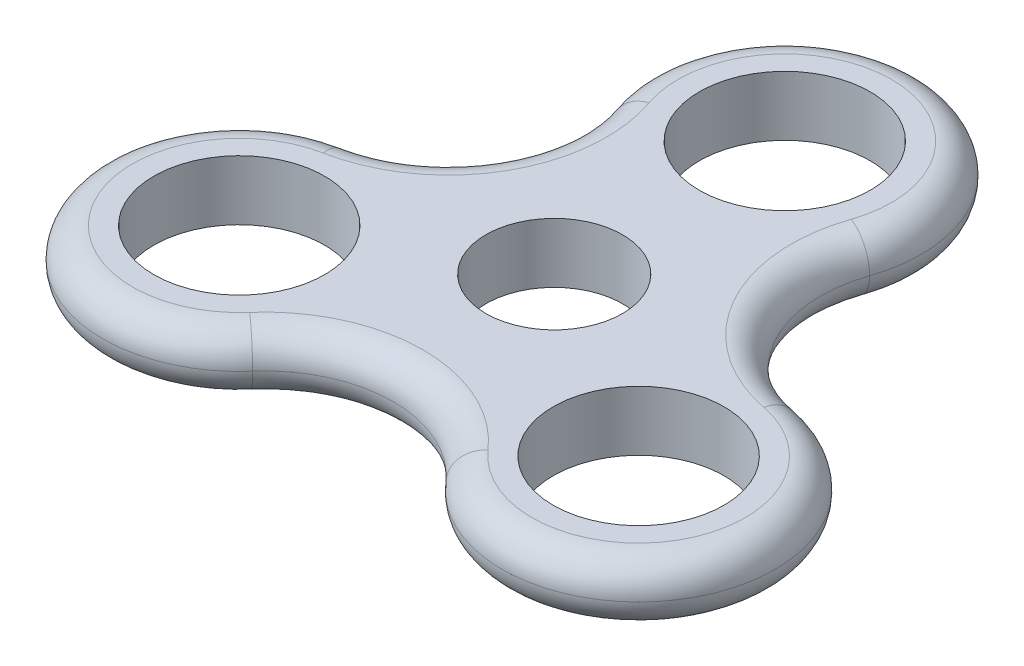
ISO-10303-21;
HEADER;
FILE_DESCRIPTION(('STEP AP214'),'2;1');
FILE_NAME('part.step','',(''),(''),'','','');
FILE_SCHEMA(('AUTOMOTIVE_DESIGN { 1 0 10303 214 1 1 1 1 }'));
ENDSEC;
DATA;
#1=APPLICATION_CONTEXT('core data for automotive mechanical design processes');
#2=APPLICATION_PROTOCOL_DEFINITION('international standard','automotive_design',2000,#1);
#3=PRODUCT_CONTEXT('',#1,'mechanical');
#4=PRODUCT('Part','Part','',(#3));
#5=PRODUCT_RELATED_PRODUCT_CATEGORY('part','',(#4));
#6=PRODUCT_DEFINITION_FORMATION('','',#4);
#7=PRODUCT_DEFINITION_CONTEXT('part definition',#1,'design');
#8=PRODUCT_DEFINITION('design','',#6,#7);
#9=PRODUCT_DEFINITION_SHAPE('','',#8);
#10=(LENGTH_UNIT() NAMED_UNIT(*) SI_UNIT(.MILLI.,.METRE.));
#11=(NAMED_UNIT(*) PLANE_ANGLE_UNIT() SI_UNIT($,.RADIAN.));
#12=(NAMED_UNIT(*) SI_UNIT($,.STERADIAN.) SOLID_ANGLE_UNIT());
#13=UNCERTAINTY_MEASURE_WITH_UNIT(LENGTH_MEASURE(1.E-05),#10,'distance_accuracy_value','');
#14=(GEOMETRIC_REPRESENTATION_CONTEXT(3) GLOBAL_UNCERTAINTY_ASSIGNED_CONTEXT((#13)) GLOBAL_UNIT_ASSIGNED_CONTEXT((#10,
#11,#12)) REPRESENTATION_CONTEXT('',''));
#15=CARTESIAN_POINT('',(0.,0.,0.));
#16=DIRECTION('',(0.,0.,1.));
#17=DIRECTION('',(1.,0.,0.));
#18=AXIS2_PLACEMENT_3D('',#15,#16,#17);
#19=CARTESIAN_POINT('',(-26.3501792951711,7.,-1.71328310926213));
#20=DIRECTION('',(0.,-1.,0.));
#21=DIRECTION('',(0.,0.,-1.));
#22=AXIS2_PLACEMENT_3D('',#19,#20,#21);
#23=PLANE('',#22);
#24=CARTESIAN_POINT('',(23.38268590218,7.,13.4999999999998));
#25=DIRECTION('',(0.,-1.,0.));
#26=DIRECTION('',(0.,0.,-1.));
#27=AXIS2_PLACEMENT_3D('',#24,#25,#26);
#28=CIRCLE('',#27,12.5);
#29=CARTESIAN_POINT('',(13.9541835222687,7.,21.7069082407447));
#30=VERTEX_POINT('',#29);
#31=CARTESIAN_POINT('',(25.7758257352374,7.,1.23122329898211));
#32=VERTEX_POINT('',#31);
#33=EDGE_CURVE('E46',#30,#32,#28,.F.);
#34=ORIENTED_EDGE('',*,*,#33,.T.);
#35=CARTESIAN_POINT('',(29.3176726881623,7.,-16.926566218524));
#36=DIRECTION('',(0.,-1.,0.));
#37=DIRECTION('',(0.,0.,-1.));
#38=AXIS2_PLACEMENT_3D('',#35,#36,#37);
#39=CIRCLE('',#38,18.5);
#40=CARTESIAN_POINT('',(11.8216422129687,7.,-22.9381315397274));
#41=VERTEX_POINT('',#40);
#42=EDGE_CURVE('E11',#32,#41,#39,.T.);
#43=ORIENTED_EDGE('',*,*,#42,.T.);
#44=CARTESIAN_POINT('',(0.,7.,-27.));
#45=DIRECTION('',(0.,-1.,0.));
#46=DIRECTION('',(0.,0.,-1.));
#47=AXIS2_PLACEMENT_3D('',#44,#45,#46);
#48=CIRCLE('',#47,12.5);
#49=CARTESIAN_POINT('',(-11.8216422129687,7.,-22.9381315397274));
#50=VERTEX_POINT('',#49);
#51=EDGE_CURVE('E195',#41,#50,#48,.F.);
#52=ORIENTED_EDGE('',*,*,#51,.T.);
#53=CARTESIAN_POINT('',(-29.3176726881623,7.,-16.926566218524));
#54=DIRECTION('',(0.,-1.,0.));
#55=DIRECTION('',(0.,0.,-1.));
#56=AXIS2_PLACEMENT_3D('',#53,#54,#55);
#57=CIRCLE('',#56,18.5);
#58=CARTESIAN_POINT('',(-25.7758257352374,7.,1.23122329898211));
#59=VERTEX_POINT('',#58);
#60=EDGE_CURVE('E119',#50,#59,#57,.T.);
#61=ORIENTED_EDGE('',*,*,#60,.T.);
#62=CARTESIAN_POINT('',(-23.38268590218,7.,13.4999999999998));
#63=DIRECTION('',(0.,-1.,0.));
#64=DIRECTION('',(0.,0.,-1.));
#65=AXIS2_PLACEMENT_3D('',#62,#63,#64);
#66=CIRCLE('',#65,12.5);
#67=CARTESIAN_POINT('',(-13.9541835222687,7.,21.7069082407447));
#68=VERTEX_POINT('',#67);
#69=EDGE_CURVE('E114',#59,#68,#66,.F.);
#70=ORIENTED_EDGE('',*,*,#69,.T.);
#71=CARTESIAN_POINT('',(0.,7.,33.8531324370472));
#72=DIRECTION('',(0.,-1.,0.));
#73=DIRECTION('',(0.,0.,-1.));
#74=AXIS2_PLACEMENT_3D('',#71,#72,#73);
#75=CIRCLE('',#74,18.5);
#76=EDGE_CURVE('E116',#68,#30,#75,.T.);
#77=ORIENTED_EDGE('',*,*,#76,.T.);
#78=EDGE_LOOP('',(#34,#43,#52,#61,#70,#77));
#79=FACE_BOUND('',#78,.T.);
#80=CARTESIAN_POINT('',(0.,7.,0.));
#81=DIRECTION('',(0.,1.,0.));
#82=DIRECTION('',(0.,0.,1.));
#83=AXIS2_PLACEMENT_3D('',#80,#81,#82);
#84=CIRCLE('',#83,8.);
#85=CARTESIAN_POINT('',(0.,7.,8.));
#86=VERTEX_POINT('',#85);
#87=EDGE_CURVE('E210',#86,#86,#84,.T.);
#88=ORIENTED_EDGE('',*,*,#87,.F.);
#89=EDGE_LOOP('',(#88));
#90=FACE_BOUND('',#89,.T.);
#91=CARTESIAN_POINT('',(-23.38268590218,7.,13.4999999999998));
#92=DIRECTION('',(0.,1.,0.));
#93=DIRECTION('',(0.,0.,1.));
#94=AXIS2_PLACEMENT_3D('',#91,#92,#93);
#95=CIRCLE('',#94,9.99999999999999);
#96=CARTESIAN_POINT('',(-23.38268590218,7.,23.4999999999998));
#97=VERTEX_POINT('',#96);
#98=EDGE_CURVE('E214',#97,#97,#95,.T.);
#99=ORIENTED_EDGE('',*,*,#98,.F.);
#100=EDGE_LOOP('',(#99));
#101=FACE_BOUND('',#100,.T.);
#102=CARTESIAN_POINT('',(23.38268590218,7.,13.4999999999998));
#103=DIRECTION('',(0.,1.,0.));
#104=DIRECTION('',(0.,0.,1.));
#105=AXIS2_PLACEMENT_3D('',#102,#103,#104);
#106=CIRCLE('',#105,10.);
#107=CARTESIAN_POINT('',(23.38268590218,7.,23.4999999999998));
#108=VERTEX_POINT('',#107);
#109=EDGE_CURVE('E220',#108,#108,#106,.T.);
#110=ORIENTED_EDGE('',*,*,#109,.F.);
#111=EDGE_LOOP('',(#110));
#112=FACE_BOUND('',#111,.T.);
#113=CARTESIAN_POINT('',(0.,7.,-27.));
#114=DIRECTION('',(0.,1.,0.));
#115=DIRECTION('',(0.,0.,1.));
#116=AXIS2_PLACEMENT_3D('',#113,#114,#115);
#117=CIRCLE('',#116,10.);
#118=CARTESIAN_POINT('',(0.,7.,-17.));
#119=VERTEX_POINT('',#118);
#120=EDGE_CURVE('E226',#119,#119,#117,.T.);
#121=ORIENTED_EDGE('',*,*,#120,.F.);
#122=EDGE_LOOP('',(#121));
#123=FACE_BOUND('',#122,.T.);
#124=ADVANCED_FACE('F36',(#79,#90,#101,#112,#123),#23,.F.);
#125=CARTESIAN_POINT('',(-26.3501792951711,0.,-1.71328310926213));
#126=DIRECTION('',(0.,-1.,0.));
#127=DIRECTION('',(0.,0.,-1.));
#128=AXIS2_PLACEMENT_3D('',#125,#126,#127);
#129=PLANE('',#128);
#130=CARTESIAN_POINT('',(0.,0.,-27.));
#131=DIRECTION('',(0.,-1.,0.));
#132=DIRECTION('',(0.,0.,-1.));
#133=AXIS2_PLACEMENT_3D('',#130,#131,#132);
#134=CIRCLE('',#133,12.5);
#135=CARTESIAN_POINT('',(-11.8216422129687,0.,-22.9381315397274));
#136=VERTEX_POINT('',#135);
#137=CARTESIAN_POINT('',(11.8216422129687,0.,-22.9381315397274));
#138=VERTEX_POINT('',#137);
#139=EDGE_CURVE('E208',#136,#138,#134,.T.);
#140=ORIENTED_EDGE('',*,*,#139,.T.);
#141=CARTESIAN_POINT('',(29.3176726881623,0.,-16.926566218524));
#142=DIRECTION('',(0.,-1.,0.));
#143=DIRECTION('',(0.,0.,-1.));
#144=AXIS2_PLACEMENT_3D('',#141,#142,#143);
#145=CIRCLE('',#144,18.5);
#146=CARTESIAN_POINT('',(25.7758257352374,0.,1.23122329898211));
#147=VERTEX_POINT('',#146);
#148=EDGE_CURVE('E197',#138,#147,#145,.F.);
#149=ORIENTED_EDGE('',*,*,#148,.T.);
#150=CARTESIAN_POINT('',(23.38268590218,0.,13.4999999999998));
#151=DIRECTION('',(0.,-1.,0.));
#152=DIRECTION('',(0.,0.,-1.));
#153=AXIS2_PLACEMENT_3D('',#150,#151,#152);
#154=CIRCLE('',#153,12.5);
#155=CARTESIAN_POINT('',(13.9541835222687,0.,21.7069082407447));
#156=VERTEX_POINT('',#155);
#157=EDGE_CURVE('E200',#147,#156,#154,.T.);
#158=ORIENTED_EDGE('',*,*,#157,.T.);
#159=CARTESIAN_POINT('',(0.,0.,33.8531324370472));
#160=DIRECTION('',(0.,-1.,0.));
#161=DIRECTION('',(0.,0.,-1.));
#162=AXIS2_PLACEMENT_3D('',#159,#160,#161);
#163=CIRCLE('',#162,18.5);
#164=CARTESIAN_POINT('',(-13.9541835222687,0.,21.7069082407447));
#165=VERTEX_POINT('',#164);
#166=EDGE_CURVE('E204',#156,#165,#163,.F.);
#167=ORIENTED_EDGE('',*,*,#166,.T.);
#168=CARTESIAN_POINT('',(-23.38268590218,0.,13.4999999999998));
#169=DIRECTION('',(0.,-1.,0.));
#170=DIRECTION('',(0.,0.,-1.));
#171=AXIS2_PLACEMENT_3D('',#168,#169,#170);
#172=CIRCLE('',#171,12.5);
#173=CARTESIAN_POINT('',(-25.7758257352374,0.,1.23122329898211));
#174=VERTEX_POINT('',#173);
#175=EDGE_CURVE('E182',#165,#174,#172,.T.);
#176=ORIENTED_EDGE('',*,*,#175,.T.);
#177=CARTESIAN_POINT('',(-29.3176726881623,0.,-16.926566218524));
#178=DIRECTION('',(0.,-1.,0.));
#179=DIRECTION('',(0.,0.,-1.));
#180=AXIS2_PLACEMENT_3D('',#177,#178,#179);
#181=CIRCLE('',#180,18.5);
#182=EDGE_CURVE('E90',#174,#136,#181,.F.);
#183=ORIENTED_EDGE('',*,*,#182,.T.);
#184=EDGE_LOOP('',(#140,#149,#158,#167,#176,#183));
#185=FACE_BOUND('',#184,.T.);
#186=CARTESIAN_POINT('',(23.38268590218,0.,13.4999999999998));
#187=DIRECTION('',(0.,1.,0.));
#188=DIRECTION('',(0.,0.,1.));
#189=AXIS2_PLACEMENT_3D('',#186,#187,#188);
#190=CIRCLE('',#189,10.);
#191=CARTESIAN_POINT('',(23.38268590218,0.,23.4999999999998));
#192=VERTEX_POINT('',#191);
#193=EDGE_CURVE('E223',#192,#192,#190,.T.);
#194=ORIENTED_EDGE('',*,*,#193,.T.);
#195=EDGE_LOOP('',(#194));
#196=FACE_BOUND('',#195,.T.);
#197=CARTESIAN_POINT('',(0.,0.,0.));
#198=DIRECTION('',(0.,1.,0.));
#199=DIRECTION('',(0.,0.,1.));
#200=AXIS2_PLACEMENT_3D('',#197,#198,#199);
#201=CIRCLE('',#200,8.);
#202=CARTESIAN_POINT('',(0.,0.,8.));
#203=VERTEX_POINT('',#202);
#204=EDGE_CURVE('E211',#203,#203,#201,.T.);
#205=ORIENTED_EDGE('',*,*,#204,.T.);
#206=EDGE_LOOP('',(#205));
#207=FACE_BOUND('',#206,.T.);
#208=CARTESIAN_POINT('',(-23.38268590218,0.,13.4999999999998));
#209=DIRECTION('',(0.,1.,0.));
#210=DIRECTION('',(0.,0.,1.));
#211=AXIS2_PLACEMENT_3D('',#208,#209,#210);
#212=CIRCLE('',#211,9.99999999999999);
#213=CARTESIAN_POINT('',(-23.38268590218,0.,23.4999999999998));
#214=VERTEX_POINT('',#213);
#215=EDGE_CURVE('E217',#214,#214,#212,.T.);
#216=ORIENTED_EDGE('',*,*,#215,.T.);
#217=EDGE_LOOP('',(#216));
#218=FACE_BOUND('',#217,.T.);
#219=CARTESIAN_POINT('',(0.,0.,-27.));
#220=DIRECTION('',(0.,1.,0.));
#221=DIRECTION('',(0.,0.,1.));
#222=AXIS2_PLACEMENT_3D('',#219,#220,#221);
#223=CIRCLE('',#222,10.);
#224=CARTESIAN_POINT('',(0.,0.,-17.));
#225=VERTEX_POINT('',#224);
#226=EDGE_CURVE('E123',#225,#225,#223,.T.);
#227=ORIENTED_EDGE('',*,*,#226,.T.);
#228=EDGE_LOOP('',(#227));
#229=FACE_BOUND('',#228,.T.);
#230=ADVANCED_FACE('F238',(#185,#196,#207,#218,#229),#129,.T.);
#231=CARTESIAN_POINT('',(0.,7.,0.));
#232=DIRECTION('',(0.,-1.,0.));
#233=DIRECTION('',(0.,0.,-1.));
#234=AXIS2_PLACEMENT_3D('',#231,#232,#233);
#235=CYLINDRICAL_SURFACE('',#234,8.);
#236=ORIENTED_EDGE('',*,*,#87,.T.);
#237=EDGE_LOOP('',(#236));
#238=FACE_BOUND('',#237,.T.);
#239=ORIENTED_EDGE('',*,*,#204,.F.);
#240=EDGE_LOOP('',(#239));
#241=FACE_BOUND('',#240,.T.);
#242=ADVANCED_FACE('F243',(#238,#241),#235,.F.);
#243=CARTESIAN_POINT('',(-23.38268590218,7.,13.4999999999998));
#244=DIRECTION('',(0.,-1.,0.));
#245=DIRECTION('',(0.,0.,-1.));
#246=AXIS2_PLACEMENT_3D('',#243,#244,#245);
#247=CYLINDRICAL_SURFACE('',#246,9.99999999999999);
#248=ORIENTED_EDGE('',*,*,#98,.T.);
#249=EDGE_LOOP('',(#248));
#250=FACE_BOUND('',#249,.T.);
#251=ORIENTED_EDGE('',*,*,#215,.F.);
#252=EDGE_LOOP('',(#251));
#253=FACE_BOUND('',#252,.T.);
#254=ADVANCED_FACE('F286',(#250,#253),#247,.F.);
#255=CARTESIAN_POINT('',(23.38268590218,7.,13.4999999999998));
#256=DIRECTION('',(0.,-1.,0.));
#257=DIRECTION('',(0.,0.,-1.));
#258=AXIS2_PLACEMENT_3D('',#255,#256,#257);
#259=CYLINDRICAL_SURFACE('',#258,10.);
#260=ORIENTED_EDGE('',*,*,#109,.T.);
#261=EDGE_LOOP('',(#260));
#262=FACE_BOUND('',#261,.T.);
#263=ORIENTED_EDGE('',*,*,#193,.F.);
#264=EDGE_LOOP('',(#263));
#265=FACE_BOUND('',#264,.T.);
#266=ADVANCED_FACE('F281',(#262,#265),#259,.F.);
#267=CARTESIAN_POINT('',(0.,7.,-27.));
#268=DIRECTION('',(0.,-1.,0.));
#269=DIRECTION('',(0.,0.,-1.));
#270=AXIS2_PLACEMENT_3D('',#267,#268,#269);
#271=CYLINDRICAL_SURFACE('',#270,10.);
#272=ORIENTED_EDGE('',*,*,#120,.T.);
#273=EDGE_LOOP('',(#272));
#274=FACE_BOUND('',#273,.T.);
#275=ORIENTED_EDGE('',*,*,#226,.F.);
#276=EDGE_LOOP('',(#275));
#277=FACE_BOUND('',#276,.T.);
#278=ADVANCED_FACE('F234',(#274,#277),#271,.F.);
#279=CARTESIAN_POINT('',(-23.38268590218,3.5,13.4999999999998));
#280=DIRECTION('',(0.,-1.,0.));
#281=DIRECTION('',(0.,0.,-1.));
#282=AXIS2_PLACEMENT_3D('',#279,#280,#281);
#283=TOROIDAL_SURFACE('',#282,12.5,3.5);
#284=CARTESIAN_POINT('',(-13.9541835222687,3.5,21.7069082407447));
#285=DIRECTION('',(0.656552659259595,0.,-0.754280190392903));
#286=DIRECTION('',(-0.754280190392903,0.,-0.656552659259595));
#287=AXIS2_PLACEMENT_3D('',#284,#285,#286);
#288=CIRCLE('',#287,3.5);
#289=CARTESIAN_POINT('',(-11.3142028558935,3.5,24.0048425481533));
#290=VERTEX_POINT('',#289);
#291=EDGE_CURVE('E40',#68,#290,#288,.T.);
#292=ORIENTED_EDGE('',*,*,#291,.F.);
#293=ORIENTED_EDGE('',*,*,#69,.F.);
#294=CARTESIAN_POINT('',(-25.7758257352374,3.5,1.23122329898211));
#295=DIRECTION('',(0.981502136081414,0.,-0.191451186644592));
#296=DIRECTION('',(-0.191451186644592,0.,-0.981502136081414));
#297=AXIS2_PLACEMENT_3D('',#294,#295,#296);
#298=CIRCLE('',#297,3.5);
#299=CARTESIAN_POINT('',(-26.4459048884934,3.5,-2.20403417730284));
#300=VERTEX_POINT('',#299);
#301=EDGE_CURVE('E76',#300,#59,#298,.T.);
#302=ORIENTED_EDGE('',*,*,#301,.F.);
#303=CARTESIAN_POINT('',(-23.38268590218,3.5,13.4999999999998));
#304=DIRECTION('',(0.,-1.,0.));
#305=DIRECTION('',(0.,0.,-1.));
#306=AXIS2_PLACEMENT_3D('',#303,#304,#305);
#307=CIRCLE('',#306,16.);
#308=EDGE_CURVE('E121',#290,#300,#307,.T.);
#309=ORIENTED_EDGE('',*,*,#308,.F.);
#310=EDGE_LOOP('',(#292,#293,#302,#309));
#311=FACE_BOUND('',#310,.T.);
#312=ADVANCED_FACE('F38',(#311),#283,.T.);
#313=CARTESIAN_POINT('',(0.,3.5,33.8531324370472));
#314=DIRECTION('',(0.,-1.,0.));
#315=DIRECTION('',(0.,0.,-1.));
#316=AXIS2_PLACEMENT_3D('',#313,#314,#315);
#317=TOROIDAL_SURFACE('',#316,18.5,3.5);
#318=ORIENTED_EDGE('',*,*,#76,.F.);
#319=ORIENTED_EDGE('',*,*,#291,.T.);
#320=CARTESIAN_POINT('',(0.,3.5,33.8531324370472));
#321=DIRECTION('',(0.,-1.,0.));
#322=DIRECTION('',(0.,0.,-1.));
#323=AXIS2_PLACEMENT_3D('',#320,#321,#322);
#324=CIRCLE('',#323,15.);
#325=CARTESIAN_POINT('',(11.3142028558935,3.5,24.0048425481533));
#326=VERTEX_POINT('',#325);
#327=EDGE_CURVE('E166',#326,#290,#324,.F.);
#328=ORIENTED_EDGE('',*,*,#327,.F.);
#329=CARTESIAN_POINT('',(13.9541835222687,3.5,21.7069082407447));
#330=DIRECTION('',(0.656552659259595,0.,0.754280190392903));
#331=DIRECTION('',(0.754280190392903,0.,-0.656552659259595));
#332=AXIS2_PLACEMENT_3D('',#329,#330,#331);
#333=CIRCLE('',#332,3.5);
#334=EDGE_CURVE('E126',#30,#326,#333,.T.);
#335=ORIENTED_EDGE('',*,*,#334,.F.);
#336=EDGE_LOOP('',(#318,#319,#328,#335));
#337=FACE_BOUND('',#336,.T.);
#338=ADVANCED_FACE('F124',(#337),#317,.T.);
#339=CARTESIAN_POINT('',(-29.3176726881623,3.5,-16.926566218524));
#340=DIRECTION('',(0.,-1.,0.));
#341=DIRECTION('',(0.,0.,-1.));
#342=AXIS2_PLACEMENT_3D('',#339,#340,#341);
#343=TOROIDAL_SURFACE('',#342,18.5,3.5);
#344=ORIENTED_EDGE('',*,*,#301,.T.);
#345=ORIENTED_EDGE('',*,*,#60,.F.);
#346=CARTESIAN_POINT('',(-11.8216422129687,3.5,-22.9381315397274));
#347=DIRECTION('',(-0.324949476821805,0.,-0.945731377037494));
#348=DIRECTION('',(-0.945731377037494,0.,0.324949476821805));
#349=AXIS2_PLACEMENT_3D('',#346,#347,#348);
#350=CIRCLE('',#349,3.5);
#351=CARTESIAN_POINT('',(-15.1317020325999,3.5,-21.8008083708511));
#352=VERTEX_POINT('',#351);
#353=EDGE_CURVE('E162',#352,#50,#350,.T.);
#354=ORIENTED_EDGE('',*,*,#353,.F.);
#355=CARTESIAN_POINT('',(-29.3176726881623,3.5,-16.926566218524));
#356=DIRECTION('',(0.,-1.,0.));
#357=DIRECTION('',(0.,0.,-1.));
#358=AXIS2_PLACEMENT_3D('',#355,#356,#357);
#359=CIRCLE('',#358,15.);
#360=EDGE_CURVE('E159',#300,#352,#359,.F.);
#361=ORIENTED_EDGE('',*,*,#360,.F.);
#362=EDGE_LOOP('',(#344,#345,#354,#361));
#363=FACE_BOUND('',#362,.T.);
#364=ADVANCED_FACE('F174',(#363),#343,.T.);
#365=CARTESIAN_POINT('',(-23.38268590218,3.5,13.4999999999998));
#366=DIRECTION('',(0.,-1.,0.));
#367=DIRECTION('',(0.,0.,-1.));
#368=AXIS2_PLACEMENT_3D('',#365,#366,#367);
#369=TOROIDAL_SURFACE('',#368,12.5,3.5);
#370=CARTESIAN_POINT('',(-25.7758257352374,3.5,1.23122329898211));
#371=DIRECTION('',(0.981502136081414,0.,-0.191451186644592));
#372=DIRECTION('',(-0.191451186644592,0.,-0.981502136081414));
#373=AXIS2_PLACEMENT_3D('',#370,#371,#372);
#374=CIRCLE('',#373,3.5);
#375=EDGE_CURVE('E156',#174,#300,#374,.T.);
#376=ORIENTED_EDGE('',*,*,#375,.F.);
#377=ORIENTED_EDGE('',*,*,#175,.F.);
#378=CARTESIAN_POINT('',(-13.9541835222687,3.5,21.7069082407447));
#379=DIRECTION('',(0.656552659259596,0.,-0.754280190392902));
#380=DIRECTION('',(-0.754280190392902,0.,-0.656552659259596));
#381=AXIS2_PLACEMENT_3D('',#378,#379,#380);
#382=CIRCLE('',#381,3.5);
#383=EDGE_CURVE('E169',#290,#165,#382,.T.);
#384=ORIENTED_EDGE('',*,*,#383,.F.);
#385=ORIENTED_EDGE('',*,*,#308,.T.);
#386=EDGE_LOOP('',(#376,#377,#384,#385));
#387=FACE_BOUND('',#386,.T.);
#388=ADVANCED_FACE('F181',(#387),#369,.T.);
#389=CARTESIAN_POINT('',(0.,3.5,33.8531324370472));
#390=DIRECTION('',(0.,-1.,0.));
#391=DIRECTION('',(0.,0.,-1.));
#392=AXIS2_PLACEMENT_3D('',#389,#390,#391);
#393=TOROIDAL_SURFACE('',#392,18.5,3.5);
#394=ORIENTED_EDGE('',*,*,#383,.T.);
#395=ORIENTED_EDGE('',*,*,#166,.F.);
#396=CARTESIAN_POINT('',(13.9541835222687,3.5,21.7069082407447));
#397=DIRECTION('',(0.656552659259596,0.,0.754280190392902));
#398=DIRECTION('',(0.754280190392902,0.,-0.656552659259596));
#399=AXIS2_PLACEMENT_3D('',#396,#397,#398);
#400=CIRCLE('',#399,3.5);
#401=EDGE_CURVE('E153',#326,#156,#400,.T.);
#402=ORIENTED_EDGE('',*,*,#401,.F.);
#403=ORIENTED_EDGE('',*,*,#327,.T.);
#404=EDGE_LOOP('',(#394,#395,#402,#403));
#405=FACE_BOUND('',#404,.T.);
#406=ADVANCED_FACE('F186',(#405),#393,.T.);
#407=CARTESIAN_POINT('',(23.38268590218,3.5,13.4999999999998));
#408=DIRECTION('',(0.,-1.,0.));
#409=DIRECTION('',(0.,0.,-1.));
#410=AXIS2_PLACEMENT_3D('',#407,#408,#409);
#411=TOROIDAL_SURFACE('',#410,12.5,3.5);
#412=ORIENTED_EDGE('',*,*,#33,.F.);
#413=ORIENTED_EDGE('',*,*,#334,.T.);
#414=CARTESIAN_POINT('',(23.38268590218,3.5,13.4999999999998));
#415=DIRECTION('',(0.,-1.,0.));
#416=DIRECTION('',(0.,0.,-1.));
#417=AXIS2_PLACEMENT_3D('',#414,#415,#416);
#418=CIRCLE('',#417,16.);
#419=CARTESIAN_POINT('',(26.4459048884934,3.5,-2.20403417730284));
#420=VERTEX_POINT('',#419);
#421=EDGE_CURVE('E150',#420,#326,#418,.T.);
#422=ORIENTED_EDGE('',*,*,#421,.F.);
#423=CARTESIAN_POINT('',(25.7758257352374,3.5,1.23122329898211));
#424=DIRECTION('',(-0.981502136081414,0.,-0.191451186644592));
#425=DIRECTION('',(-0.191451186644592,0.,0.981502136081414));
#426=AXIS2_PLACEMENT_3D('',#423,#424,#425);
#427=CIRCLE('',#426,3.5);
#428=EDGE_CURVE('E147',#32,#420,#427,.T.);
#429=ORIENTED_EDGE('',*,*,#428,.F.);
#430=EDGE_LOOP('',(#412,#413,#422,#429));
#431=FACE_BOUND('',#430,.T.);
#432=ADVANCED_FACE('F188',(#431),#411,.T.);
#433=CARTESIAN_POINT('',(0.,3.5,-27.));
#434=DIRECTION('',(0.,-1.,0.));
#435=DIRECTION('',(0.,0.,-1.));
#436=AXIS2_PLACEMENT_3D('',#433,#434,#435);
#437=TOROIDAL_SURFACE('',#436,12.5,3.5);
#438=ORIENTED_EDGE('',*,*,#353,.T.);
#439=ORIENTED_EDGE('',*,*,#51,.F.);
#440=CARTESIAN_POINT('',(11.8216422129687,3.5,-22.9381315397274));
#441=DIRECTION('',(-0.324949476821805,0.,0.945731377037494));
#442=DIRECTION('',(0.945731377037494,0.,0.324949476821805));
#443=AXIS2_PLACEMENT_3D('',#440,#441,#442);
#444=CIRCLE('',#443,3.5);
#445=CARTESIAN_POINT('',(15.1317020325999,3.5,-21.8008083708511));
#446=VERTEX_POINT('',#445);
#447=EDGE_CURVE('E145',#446,#41,#444,.T.);
#448=ORIENTED_EDGE('',*,*,#447,.F.);
#449=CARTESIAN_POINT('',(0.,3.5,-27.));
#450=DIRECTION('',(0.,-1.,0.));
#451=DIRECTION('',(0.,0.,-1.));
#452=AXIS2_PLACEMENT_3D('',#449,#450,#451);
#453=CIRCLE('',#452,16.);
#454=EDGE_CURVE('E142',#352,#446,#453,.T.);
#455=ORIENTED_EDGE('',*,*,#454,.F.);
#456=EDGE_LOOP('',(#438,#439,#448,#455));
#457=FACE_BOUND('',#456,.T.);
#458=ADVANCED_FACE('F264',(#457),#437,.T.);
#459=CARTESIAN_POINT('',(-29.3176726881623,3.5,-16.926566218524));
#460=DIRECTION('',(0.,-1.,0.));
#461=DIRECTION('',(0.,0.,-1.));
#462=AXIS2_PLACEMENT_3D('',#459,#460,#461);
#463=TOROIDAL_SURFACE('',#462,18.5,3.5);
#464=ORIENTED_EDGE('',*,*,#375,.T.);
#465=ORIENTED_EDGE('',*,*,#360,.T.);
#466=CARTESIAN_POINT('',(-11.8216422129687,3.5,-22.9381315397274));
#467=DIRECTION('',(-0.324949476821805,0.,-0.945731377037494));
#468=DIRECTION('',(-0.945731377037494,0.,0.324949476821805));
#469=AXIS2_PLACEMENT_3D('',#466,#467,#468);
#470=CIRCLE('',#469,3.5);
#471=EDGE_CURVE('E139',#136,#352,#470,.T.);
#472=ORIENTED_EDGE('',*,*,#471,.F.);
#473=ORIENTED_EDGE('',*,*,#182,.F.);
#474=EDGE_LOOP('',(#464,#465,#472,#473));
#475=FACE_BOUND('',#474,.T.);
#476=ADVANCED_FACE('F178',(#475),#463,.T.);
#477=CARTESIAN_POINT('',(23.38268590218,3.5,13.4999999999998));
#478=DIRECTION('',(0.,-1.,0.));
#479=DIRECTION('',(0.,0.,-1.));
#480=AXIS2_PLACEMENT_3D('',#477,#478,#479);
#481=TOROIDAL_SURFACE('',#480,12.5,3.5);
#482=ORIENTED_EDGE('',*,*,#401,.T.);
#483=ORIENTED_EDGE('',*,*,#157,.F.);
#484=CARTESIAN_POINT('',(25.7758257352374,3.5,1.23122329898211));
#485=DIRECTION('',(-0.981502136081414,0.,-0.191451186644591));
#486=DIRECTION('',(-0.191451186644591,0.,0.981502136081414));
#487=AXIS2_PLACEMENT_3D('',#484,#485,#486);
#488=CIRCLE('',#487,3.5);
#489=EDGE_CURVE('E137',#420,#147,#488,.T.);
#490=ORIENTED_EDGE('',*,*,#489,.F.);
#491=ORIENTED_EDGE('',*,*,#421,.T.);
#492=EDGE_LOOP('',(#482,#483,#490,#491));
#493=FACE_BOUND('',#492,.T.);
#494=ADVANCED_FACE('F258',(#493),#481,.T.);
#495=CARTESIAN_POINT('',(29.3176726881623,3.5,-16.926566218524));
#496=DIRECTION('',(0.,-1.,0.));
#497=DIRECTION('',(0.,0.,-1.));
#498=AXIS2_PLACEMENT_3D('',#495,#496,#497);
#499=TOROIDAL_SURFACE('',#498,18.5,3.5);
#500=ORIENTED_EDGE('',*,*,#42,.F.);
#501=ORIENTED_EDGE('',*,*,#428,.T.);
#502=CARTESIAN_POINT('',(29.3176726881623,3.5,-16.926566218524));
#503=DIRECTION('',(0.,-1.,0.));
#504=DIRECTION('',(0.,0.,-1.));
#505=AXIS2_PLACEMENT_3D('',#502,#503,#504);
#506=CIRCLE('',#505,15.);
#507=EDGE_CURVE('E134',#446,#420,#506,.F.);
#508=ORIENTED_EDGE('',*,*,#507,.F.);
#509=ORIENTED_EDGE('',*,*,#447,.T.);
#510=EDGE_LOOP('',(#500,#501,#508,#509));
#511=FACE_BOUND('',#510,.T.);
#512=ADVANCED_FACE('F193',(#511),#499,.T.);
#513=CARTESIAN_POINT('',(0.,3.5,-27.));
#514=DIRECTION('',(0.,-1.,0.));
#515=DIRECTION('',(0.,0.,-1.));
#516=AXIS2_PLACEMENT_3D('',#513,#514,#515);
#517=TOROIDAL_SURFACE('',#516,12.5,3.5);
#518=ORIENTED_EDGE('',*,*,#471,.T.);
#519=ORIENTED_EDGE('',*,*,#454,.T.);
#520=CARTESIAN_POINT('',(11.8216422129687,3.5,-22.9381315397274));
#521=DIRECTION('',(-0.324949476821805,0.,0.945731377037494));
#522=DIRECTION('',(0.945731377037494,0.,0.324949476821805));
#523=AXIS2_PLACEMENT_3D('',#520,#521,#522);
#524=CIRCLE('',#523,3.5);
#525=EDGE_CURVE('E131',#138,#446,#524,.T.);
#526=ORIENTED_EDGE('',*,*,#525,.F.);
#527=ORIENTED_EDGE('',*,*,#139,.F.);
#528=EDGE_LOOP('',(#518,#519,#526,#527));
#529=FACE_BOUND('',#528,.T.);
#530=ADVANCED_FACE('F251',(#529),#517,.T.);
#531=CARTESIAN_POINT('',(29.3176726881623,3.5,-16.926566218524));
#532=DIRECTION('',(0.,-1.,0.));
#533=DIRECTION('',(0.,0.,-1.));
#534=AXIS2_PLACEMENT_3D('',#531,#532,#533);
#535=TOROIDAL_SURFACE('',#534,18.5,3.5);
#536=ORIENTED_EDGE('',*,*,#489,.T.);
#537=ORIENTED_EDGE('',*,*,#148,.F.);
#538=ORIENTED_EDGE('',*,*,#525,.T.);
#539=ORIENTED_EDGE('',*,*,#507,.T.);
#540=EDGE_LOOP('',(#536,#537,#538,#539));
#541=FACE_BOUND('',#540,.T.);
#542=ADVANCED_FACE('F248',(#541),#535,.T.);
#543=CLOSED_SHELL('',(#124,#230,#242,#254,#266,#278,#312,#338,#364,#388,#406,#432,#458,#476,
#494,#512,#530,#542));
#544=MANIFOLD_SOLID_BREP('B2',#543);
#545=ADVANCED_BREP_SHAPE_REPRESENTATION('',(#18,#544),#14);
#546=SHAPE_DEFINITION_REPRESENTATION(#9,#545);
ENDSEC;
END-ISO-10303-21;
